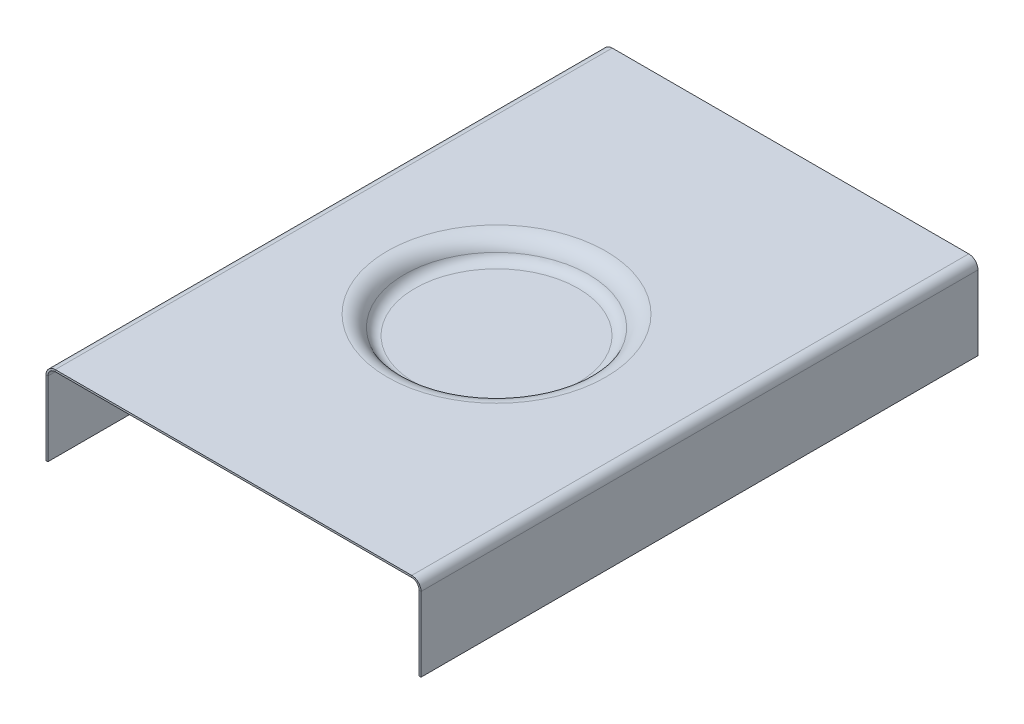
ISO-10303-21;
HEADER;
FILE_DESCRIPTION(('STEP AP214'),'2;1');
FILE_NAME('part.step','',(''),(''),'','','');
FILE_SCHEMA(('AUTOMOTIVE_DESIGN { 1 0 10303 214 1 1 1 1 }'));
ENDSEC;
DATA;
#1=APPLICATION_CONTEXT('core data for automotive mechanical design processes');
#2=APPLICATION_PROTOCOL_DEFINITION('international standard','automotive_design',2000,#1);
#3=PRODUCT_CONTEXT('',#1,'mechanical');
#4=PRODUCT('Part','Part','',(#3));
#5=PRODUCT_RELATED_PRODUCT_CATEGORY('part','',(#4));
#6=PRODUCT_DEFINITION_FORMATION('','',#4);
#7=PRODUCT_DEFINITION_CONTEXT('part definition',#1,'design');
#8=PRODUCT_DEFINITION('design','',#6,#7);
#9=PRODUCT_DEFINITION_SHAPE('','',#8);
#10=(LENGTH_UNIT() NAMED_UNIT(*) SI_UNIT(.MILLI.,.METRE.));
#11=(NAMED_UNIT(*) PLANE_ANGLE_UNIT() SI_UNIT($,.RADIAN.));
#12=(NAMED_UNIT(*) SI_UNIT($,.STERADIAN.) SOLID_ANGLE_UNIT());
#13=UNCERTAINTY_MEASURE_WITH_UNIT(LENGTH_MEASURE(1.E-05),#10,'distance_accuracy_value','');
#14=(GEOMETRIC_REPRESENTATION_CONTEXT(3) GLOBAL_UNCERTAINTY_ASSIGNED_CONTEXT((#13)) GLOBAL_UNIT_ASSIGNED_CONTEXT((#10,
#11,#12)) REPRESENTATION_CONTEXT('',''));
#15=CARTESIAN_POINT('',(0.,0.,0.));
#16=DIRECTION('',(0.,0.,1.));
#17=DIRECTION('',(1.,0.,0.));
#18=AXIS2_PLACEMENT_3D('',#15,#16,#17);
#19=CARTESIAN_POINT('',(0.,-0.5,150.));
#20=DIRECTION('',(0.,1.,0.));
#21=DIRECTION('',(0.,0.,1.));
#22=AXIS2_PLACEMENT_3D('',#19,#20,#21);
#23=PLANE('',#22);
#24=CARTESIAN_POINT('',(48.4701864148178,-0.500000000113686,77.6373406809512));
#25=DIRECTION('',(0.,1.,0.));
#26=DIRECTION('',(0.,0.,1.));
#27=AXIS2_PLACEMENT_3D('',#24,#25,#26);
#28=CIRCLE('',#27,29.4161984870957);
#29=CARTESIAN_POINT('',(48.4701864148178,-0.500000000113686,107.053539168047));
#30=VERTEX_POINT('',#29);
#31=EDGE_CURVE('E184',#30,#30,#28,.F.);
#32=ORIENTED_EDGE('',*,*,#31,.F.);
#33=EDGE_LOOP('',(#32));
#34=FACE_BOUND('',#33,.T.);
#35=DIRECTION('',(0.,0.,-1.));
#36=VECTOR('',#35,1.);
#37=CARTESIAN_POINT('',(1.99999999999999,-0.5,0.));
#38=LINE('',#37,#36);
#39=CARTESIAN_POINT('',(1.99999999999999,-0.5,0.));
#40=VERTEX_POINT('',#39);
#41=CARTESIAN_POINT('',(1.99999999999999,-0.5,150.));
#42=VERTEX_POINT('',#41);
#43=EDGE_CURVE('E160',#40,#42,#38,.F.);
#44=ORIENTED_EDGE('',*,*,#43,.F.);
#45=DIRECTION('',(1.,0.,0.));
#46=VECTOR('',#45,1.);
#47=CARTESIAN_POINT('',(0.,-0.5,0.));
#48=LINE('',#47,#46);
#49=CARTESIAN_POINT('',(98.,-0.49999999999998,0.));
#50=VERTEX_POINT('',#49);
#51=EDGE_CURVE('E152',#40,#50,#48,.T.);
#52=ORIENTED_EDGE('',*,*,#51,.T.);
#53=DIRECTION('',(0.,0.,1.));
#54=VECTOR('',#53,1.);
#55=CARTESIAN_POINT('',(98.,-0.49999999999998,150.));
#56=LINE('',#55,#54);
#57=CARTESIAN_POINT('',(98.,-0.49999999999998,150.));
#58=VERTEX_POINT('',#57);
#59=EDGE_CURVE('E100',#58,#50,#56,.F.);
#60=ORIENTED_EDGE('',*,*,#59,.F.);
#61=DIRECTION('',(1.,0.,0.));
#62=VECTOR('',#61,1.);
#63=CARTESIAN_POINT('',(0.,-0.5,150.));
#64=LINE('',#63,#62);
#65=EDGE_CURVE('E41',#42,#58,#64,.T.);
#66=ORIENTED_EDGE('',*,*,#65,.F.);
#67=EDGE_LOOP('',(#44,#52,#60,#66));
#68=FACE_BOUND('',#67,.T.);
#69=ADVANCED_FACE('F33',(#34,#68),#23,.F.);
#70=CARTESIAN_POINT('',(0.,0.,150.));
#71=DIRECTION('',(0.,1.,0.));
#72=DIRECTION('',(0.,0.,1.));
#73=AXIS2_PLACEMENT_3D('',#70,#71,#72);
#74=PLANE('',#73);
#75=CARTESIAN_POINT('',(48.4701864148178,-1.13686837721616E-10,77.6373406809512));
#76=DIRECTION('',(0.,1.,0.));
#77=DIRECTION('',(0.,0.,1.));
#78=AXIS2_PLACEMENT_3D('',#75,#76,#77);
#79=CIRCLE('',#78,29.4161984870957);
#80=CARTESIAN_POINT('',(48.4701864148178,-1.13686837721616E-10,107.053539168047));
#81=VERTEX_POINT('',#80);
#82=EDGE_CURVE('E197',#81,#81,#79,.F.);
#83=ORIENTED_EDGE('',*,*,#82,.T.);
#84=EDGE_LOOP('',(#83));
#85=FACE_BOUND('',#84,.T.);
#86=DIRECTION('',(1.,0.,0.));
#87=VECTOR('',#86,1.);
#88=CARTESIAN_POINT('',(0.,0.,0.));
#89=LINE('',#88,#87);
#90=CARTESIAN_POINT('',(1.99999999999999,0.,0.));
#91=VERTEX_POINT('',#90);
#92=CARTESIAN_POINT('',(98.,0.,0.));
#93=VERTEX_POINT('',#92);
#94=EDGE_CURVE('E36',#91,#93,#89,.T.);
#95=ORIENTED_EDGE('',*,*,#94,.F.);
#96=DIRECTION('',(0.,0.,-1.));
#97=VECTOR('',#96,1.);
#98=CARTESIAN_POINT('',(1.99999999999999,0.,0.));
#99=LINE('',#98,#97);
#100=CARTESIAN_POINT('',(1.99999999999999,0.,150.));
#101=VERTEX_POINT('',#100);
#102=EDGE_CURVE('E237',#91,#101,#99,.F.);
#103=ORIENTED_EDGE('',*,*,#102,.T.);
#104=DIRECTION('',(1.,0.,0.));
#105=VECTOR('',#104,1.);
#106=CARTESIAN_POINT('',(0.,0.,150.));
#107=LINE('',#106,#105);
#108=CARTESIAN_POINT('',(98.,0.,150.));
#109=VERTEX_POINT('',#108);
#110=EDGE_CURVE('E11',#101,#109,#107,.T.);
#111=ORIENTED_EDGE('',*,*,#110,.T.);
#112=DIRECTION('',(0.,0.,1.));
#113=VECTOR('',#112,1.);
#114=CARTESIAN_POINT('',(98.,0.,150.));
#115=LINE('',#114,#113);
#116=EDGE_CURVE('E140',#109,#93,#115,.F.);
#117=ORIENTED_EDGE('',*,*,#116,.T.);
#118=EDGE_LOOP('',(#95,#103,#111,#117));
#119=FACE_BOUND('',#118,.T.);
#120=ADVANCED_FACE('F173',(#85,#119),#74,.T.);
#121=CARTESIAN_POINT('',(100.,-0.5,150.));
#122=DIRECTION('',(0.,0.,-1.));
#123=DIRECTION('',(-1.,0.,0.));
#124=AXIS2_PLACEMENT_3D('',#121,#122,#123);
#125=PLANE('',#124);
#126=DIRECTION('',(0.,1.,0.));
#127=VECTOR('',#126,1.);
#128=CARTESIAN_POINT('',(1.99999999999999,-0.5,150.));
#129=LINE('',#128,#127);
#130=EDGE_CURVE('E125',#42,#101,#129,.T.);
#131=ORIENTED_EDGE('',*,*,#130,.F.);
#132=ORIENTED_EDGE('',*,*,#65,.T.);
#133=DIRECTION('',(0.,1.,0.));
#134=VECTOR('',#133,1.);
#135=CARTESIAN_POINT('',(98.,-0.49999999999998,150.));
#136=LINE('',#135,#134);
#137=EDGE_CURVE('E99',#58,#109,#136,.T.);
#138=ORIENTED_EDGE('',*,*,#137,.T.);
#139=ORIENTED_EDGE('',*,*,#110,.F.);
#140=EDGE_LOOP('',(#131,#132,#138,#139));
#141=FACE_BOUND('',#140,.T.);
#142=ADVANCED_FACE('F165',(#141),#125,.F.);
#143=CARTESIAN_POINT('',(100.,-0.5,0.));
#144=DIRECTION('',(0.,0.,-1.));
#145=DIRECTION('',(-1.,0.,0.));
#146=AXIS2_PLACEMENT_3D('',#143,#144,#145);
#147=PLANE('',#146);
#148=ORIENTED_EDGE('',*,*,#51,.F.);
#149=DIRECTION('',(0.,1.,0.));
#150=VECTOR('',#149,1.);
#151=CARTESIAN_POINT('',(1.99999999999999,-0.5,0.));
#152=LINE('',#151,#150);
#153=EDGE_CURVE('E243',#40,#91,#152,.T.);
#154=ORIENTED_EDGE('',*,*,#153,.T.);
#155=ORIENTED_EDGE('',*,*,#94,.T.);
#156=DIRECTION('',(0.,1.,0.));
#157=VECTOR('',#156,1.);
#158=CARTESIAN_POINT('',(98.,-0.49999999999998,0.));
#159=LINE('',#158,#157);
#160=EDGE_CURVE('E149',#50,#93,#159,.T.);
#161=ORIENTED_EDGE('',*,*,#160,.F.);
#162=EDGE_LOOP('',(#148,#154,#155,#161));
#163=FACE_BOUND('',#162,.T.);
#164=ADVANCED_FACE('F163',(#163),#147,.T.);
#165=CARTESIAN_POINT('',(98.,-2.5,0.));
#166=DIRECTION('',(0.,0.,-1.));
#167=DIRECTION('',(-1.,0.,0.));
#168=AXIS2_PLACEMENT_3D('',#165,#166,#167);
#169=PLANE('',#168);
#170=DIRECTION('',(1.,0.,0.));
#171=VECTOR('',#170,1.);
#172=CARTESIAN_POINT('',(100.,-2.49999999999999,0.));
#173=LINE('',#172,#171);
#174=CARTESIAN_POINT('',(100.,-2.49999999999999,0.));
#175=VERTEX_POINT('',#174);
#176=CARTESIAN_POINT('',(100.5,-2.49999999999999,0.));
#177=VERTEX_POINT('',#176);
#178=EDGE_CURVE('E89',#175,#177,#173,.T.);
#179=ORIENTED_EDGE('',*,*,#178,.F.);
#180=CARTESIAN_POINT('',(98.,-2.5,0.));
#181=DIRECTION('',(0.,0.,1.));
#182=DIRECTION('',(1.,0.,0.));
#183=AXIS2_PLACEMENT_3D('',#180,#181,#182);
#184=CIRCLE('',#183,2.00000000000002);
#185=EDGE_CURVE('E83',#50,#175,#184,.F.);
#186=ORIENTED_EDGE('',*,*,#185,.F.);
#187=ORIENTED_EDGE('',*,*,#160,.T.);
#188=CARTESIAN_POINT('',(98.,-2.5,0.));
#189=DIRECTION('',(0.,0.,1.));
#190=DIRECTION('',(1.,0.,0.));
#191=AXIS2_PLACEMENT_3D('',#188,#189,#190);
#192=CIRCLE('',#191,2.50000000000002);
#193=EDGE_CURVE('E142',#93,#177,#192,.F.);
#194=ORIENTED_EDGE('',*,*,#193,.T.);
#195=EDGE_LOOP('',(#179,#186,#187,#194));
#196=FACE_BOUND('',#195,.T.);
#197=ADVANCED_FACE('F162',(#196),#169,.T.);
#198=CARTESIAN_POINT('',(98.,-2.5,150.));
#199=DIRECTION('',(0.,0.,-1.));
#200=DIRECTION('',(-1.,0.,0.));
#201=AXIS2_PLACEMENT_3D('',#198,#199,#200);
#202=PLANE('',#201);
#203=CARTESIAN_POINT('',(98.,-2.5,150.));
#204=DIRECTION('',(0.,0.,1.));
#205=DIRECTION('',(1.,0.,0.));
#206=AXIS2_PLACEMENT_3D('',#203,#204,#205);
#207=CIRCLE('',#206,2.00000000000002);
#208=CARTESIAN_POINT('',(100.,-2.49999999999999,150.));
#209=VERTEX_POINT('',#208);
#210=EDGE_CURVE('E80',#209,#58,#207,.T.);
#211=ORIENTED_EDGE('',*,*,#210,.F.);
#212=DIRECTION('',(1.,0.,0.));
#213=VECTOR('',#212,1.);
#214=CARTESIAN_POINT('',(100.,-2.49999999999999,150.));
#215=LINE('',#214,#213);
#216=CARTESIAN_POINT('',(100.5,-2.49999999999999,150.));
#217=VERTEX_POINT('',#216);
#218=EDGE_CURVE('E88',#209,#217,#215,.T.);
#219=ORIENTED_EDGE('',*,*,#218,.T.);
#220=CARTESIAN_POINT('',(98.,-2.5,150.));
#221=DIRECTION('',(0.,0.,1.));
#222=DIRECTION('',(1.,0.,0.));
#223=AXIS2_PLACEMENT_3D('',#220,#221,#222);
#224=CIRCLE('',#223,2.50000000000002);
#225=EDGE_CURVE('E143',#217,#109,#224,.T.);
#226=ORIENTED_EDGE('',*,*,#225,.T.);
#227=ORIENTED_EDGE('',*,*,#137,.F.);
#228=EDGE_LOOP('',(#211,#219,#226,#227));
#229=FACE_BOUND('',#228,.T.);
#230=ADVANCED_FACE('F94',(#229),#202,.F.);
#231=CARTESIAN_POINT('',(98.,-2.5,150.));
#232=DIRECTION('',(0.,0.,1.));
#233=DIRECTION('',(1.,0.,0.));
#234=AXIS2_PLACEMENT_3D('',#231,#232,#233);
#235=CYLINDRICAL_SURFACE('',#234,2.50000000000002);
#236=ORIENTED_EDGE('',*,*,#116,.F.);
#237=ORIENTED_EDGE('',*,*,#225,.F.);
#238=DIRECTION('',(0.,0.,1.));
#239=VECTOR('',#238,1.);
#240=CARTESIAN_POINT('',(100.5,-2.49999999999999,150.));
#241=LINE('',#240,#239);
#242=EDGE_CURVE('E118',#177,#217,#241,.T.);
#243=ORIENTED_EDGE('',*,*,#242,.F.);
#244=ORIENTED_EDGE('',*,*,#193,.F.);
#245=EDGE_LOOP('',(#236,#237,#243,#244));
#246=FACE_BOUND('',#245,.T.);
#247=ADVANCED_FACE('F172',(#246),#235,.T.);
#248=CARTESIAN_POINT('',(98.,-2.5,150.));
#249=DIRECTION('',(0.,0.,1.));
#250=DIRECTION('',(1.,0.,0.));
#251=AXIS2_PLACEMENT_3D('',#248,#249,#250);
#252=CYLINDRICAL_SURFACE('',#251,2.00000000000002);
#253=ORIENTED_EDGE('',*,*,#59,.T.);
#254=ORIENTED_EDGE('',*,*,#185,.T.);
#255=DIRECTION('',(0.,0.,1.));
#256=VECTOR('',#255,1.);
#257=CARTESIAN_POINT('',(100.,-2.49999999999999,0.));
#258=LINE('',#257,#256);
#259=EDGE_CURVE('E76',#175,#209,#258,.T.);
#260=ORIENTED_EDGE('',*,*,#259,.T.);
#261=ORIENTED_EDGE('',*,*,#210,.T.);
#262=EDGE_LOOP('',(#253,#254,#260,#261));
#263=FACE_BOUND('',#262,.T.);
#264=ADVANCED_FACE('F79',(#263),#252,.F.);
#265=CARTESIAN_POINT('',(100.5,-0.499999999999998,150.));
#266=DIRECTION('',(0.,0.,1.));
#267=DIRECTION('',(1.,0.,0.));
#268=AXIS2_PLACEMENT_3D('',#265,#266,#267);
#269=PLANE('',#268);
#270=DIRECTION('',(0.,1.,0.));
#271=VECTOR('',#270,1.);
#272=CARTESIAN_POINT('',(100.5,-0.499999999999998,150.));
#273=LINE('',#272,#271);
#274=CARTESIAN_POINT('',(100.5,-22.5,150.));
#275=VERTEX_POINT('',#274);
#276=EDGE_CURVE('E117',#275,#217,#273,.T.);
#277=ORIENTED_EDGE('',*,*,#276,.T.);
#278=ORIENTED_EDGE('',*,*,#218,.F.);
#279=DIRECTION('',(0.,1.,0.));
#280=VECTOR('',#279,1.);
#281=CARTESIAN_POINT('',(100.,-0.5,150.));
#282=LINE('',#281,#280);
#283=CARTESIAN_POINT('',(100.,-22.5,150.));
#284=VERTEX_POINT('',#283);
#285=EDGE_CURVE('E105',#284,#209,#282,.T.);
#286=ORIENTED_EDGE('',*,*,#285,.F.);
#287=DIRECTION('',(-1.,0.,0.));
#288=VECTOR('',#287,1.);
#289=CARTESIAN_POINT('',(100.5,-22.5,150.));
#290=LINE('',#289,#288);
#291=EDGE_CURVE('E101',#275,#284,#290,.T.);
#292=ORIENTED_EDGE('',*,*,#291,.F.);
#293=EDGE_LOOP('',(#277,#278,#286,#292));
#294=FACE_BOUND('',#293,.T.);
#295=ADVANCED_FACE('F115',(#294),#269,.T.);
#296=CARTESIAN_POINT('',(100.5,-22.5,0.));
#297=DIRECTION('',(0.,0.,-1.));
#298=DIRECTION('',(-1.,0.,0.));
#299=AXIS2_PLACEMENT_3D('',#296,#297,#298);
#300=PLANE('',#299);
#301=DIRECTION('',(0.,-1.,0.));
#302=VECTOR('',#301,1.);
#303=CARTESIAN_POINT('',(100.,-22.5,0.));
#304=LINE('',#303,#302);
#305=CARTESIAN_POINT('',(100.,-22.5,0.));
#306=VERTEX_POINT('',#305);
#307=EDGE_CURVE('E120',#175,#306,#304,.T.);
#308=ORIENTED_EDGE('',*,*,#307,.F.);
#309=ORIENTED_EDGE('',*,*,#178,.T.);
#310=DIRECTION('',(0.,-1.,0.));
#311=VECTOR('',#310,1.);
#312=CARTESIAN_POINT('',(100.5,-22.5,0.));
#313=LINE('',#312,#311);
#314=CARTESIAN_POINT('',(100.5,-22.5,0.));
#315=VERTEX_POINT('',#314);
#316=EDGE_CURVE('E112',#177,#315,#313,.T.);
#317=ORIENTED_EDGE('',*,*,#316,.T.);
#318=DIRECTION('',(-1.,0.,0.));
#319=VECTOR('',#318,1.);
#320=CARTESIAN_POINT('',(100.5,-22.5,0.));
#321=LINE('',#320,#319);
#322=EDGE_CURVE('E133',#315,#306,#321,.T.);
#323=ORIENTED_EDGE('',*,*,#322,.T.);
#324=EDGE_LOOP('',(#308,#309,#317,#323));
#325=FACE_BOUND('',#324,.T.);
#326=ADVANCED_FACE('F294',(#325),#300,.T.);
#327=CARTESIAN_POINT('',(100.5,-0.499999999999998,150.));
#328=DIRECTION('',(1.,0.,0.));
#329=DIRECTION('',(0.,1.,0.));
#330=AXIS2_PLACEMENT_3D('',#327,#328,#329);
#331=PLANE('',#330);
#332=ORIENTED_EDGE('',*,*,#316,.F.);
#333=ORIENTED_EDGE('',*,*,#242,.T.);
#334=ORIENTED_EDGE('',*,*,#276,.F.);
#335=DIRECTION('',(0.,0.,1.));
#336=VECTOR('',#335,1.);
#337=CARTESIAN_POINT('',(100.5,-22.5,150.));
#338=LINE('',#337,#336);
#339=EDGE_CURVE('E129',#315,#275,#338,.T.);
#340=ORIENTED_EDGE('',*,*,#339,.F.);
#341=EDGE_LOOP('',(#332,#333,#334,#340));
#342=FACE_BOUND('',#341,.T.);
#343=ADVANCED_FACE('F292',(#342),#331,.T.);
#344=CARTESIAN_POINT('',(100.,-0.5,150.));
#345=DIRECTION('',(1.,0.,0.));
#346=DIRECTION('',(0.,1.,0.));
#347=AXIS2_PLACEMENT_3D('',#344,#345,#346);
#348=PLANE('',#347);
#349=ORIENTED_EDGE('',*,*,#259,.F.);
#350=ORIENTED_EDGE('',*,*,#307,.T.);
#351=DIRECTION('',(0.,0.,1.));
#352=VECTOR('',#351,1.);
#353=CARTESIAN_POINT('',(100.,-22.5,150.));
#354=LINE('',#353,#352);
#355=EDGE_CURVE('E109',#306,#284,#354,.T.);
#356=ORIENTED_EDGE('',*,*,#355,.T.);
#357=ORIENTED_EDGE('',*,*,#285,.T.);
#358=EDGE_LOOP('',(#349,#350,#356,#357));
#359=FACE_BOUND('',#358,.T.);
#360=ADVANCED_FACE('F106',(#359),#348,.F.);
#361=CARTESIAN_POINT('',(100.5,-22.5,150.));
#362=DIRECTION('',(0.,-1.,0.));
#363=DIRECTION('',(1.,0.,0.));
#364=AXIS2_PLACEMENT_3D('',#361,#362,#363);
#365=PLANE('',#364);
#366=ORIENTED_EDGE('',*,*,#355,.F.);
#367=ORIENTED_EDGE('',*,*,#322,.F.);
#368=ORIENTED_EDGE('',*,*,#339,.T.);
#369=ORIENTED_EDGE('',*,*,#291,.T.);
#370=EDGE_LOOP('',(#366,#367,#368,#369));
#371=FACE_BOUND('',#370,.T.);
#372=ADVANCED_FACE('F287',(#371),#365,.T.);
#373=CARTESIAN_POINT('',(1.99999999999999,-2.5,150.));
#374=DIRECTION('',(0.,0.,1.));
#375=DIRECTION('',(1.,0.,0.));
#376=AXIS2_PLACEMENT_3D('',#373,#374,#375);
#377=PLANE('',#376);
#378=DIRECTION('',(-1.,0.,0.));
#379=VECTOR('',#378,1.);
#380=CARTESIAN_POINT('',(0.,-2.49999999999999,150.));
#381=LINE('',#380,#379);
#382=CARTESIAN_POINT('',(0.,-2.49999999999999,150.));
#383=VERTEX_POINT('',#382);
#384=CARTESIAN_POINT('',(-0.500000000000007,-2.49999999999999,150.));
#385=VERTEX_POINT('',#384);
#386=EDGE_CURVE('E200',#383,#385,#381,.T.);
#387=ORIENTED_EDGE('',*,*,#386,.F.);
#388=CARTESIAN_POINT('',(1.99999999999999,-2.5,150.));
#389=DIRECTION('',(0.,0.,-1.));
#390=DIRECTION('',(-1.,0.,0.));
#391=AXIS2_PLACEMENT_3D('',#388,#389,#390);
#392=CIRCLE('',#391,2.);
#393=EDGE_CURVE('E246',#42,#383,#392,.F.);
#394=ORIENTED_EDGE('',*,*,#393,.F.);
#395=ORIENTED_EDGE('',*,*,#130,.T.);
#396=CARTESIAN_POINT('',(1.99999999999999,-2.5,150.));
#397=DIRECTION('',(0.,0.,-1.));
#398=DIRECTION('',(-1.,0.,0.));
#399=AXIS2_PLACEMENT_3D('',#396,#397,#398);
#400=CIRCLE('',#399,2.5);
#401=EDGE_CURVE('E239',#101,#385,#400,.F.);
#402=ORIENTED_EDGE('',*,*,#401,.T.);
#403=EDGE_LOOP('',(#387,#394,#395,#402));
#404=FACE_BOUND('',#403,.T.);
#405=ADVANCED_FACE('F357',(#404),#377,.T.);
#406=CARTESIAN_POINT('',(1.99999999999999,-2.5,0.));
#407=DIRECTION('',(0.,0.,1.));
#408=DIRECTION('',(1.,0.,0.));
#409=AXIS2_PLACEMENT_3D('',#406,#407,#408);
#410=PLANE('',#409);
#411=CARTESIAN_POINT('',(1.99999999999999,-2.5,0.));
#412=DIRECTION('',(0.,0.,-1.));
#413=DIRECTION('',(-1.,0.,0.));
#414=AXIS2_PLACEMENT_3D('',#411,#412,#413);
#415=CIRCLE('',#414,2.);
#416=CARTESIAN_POINT('',(0.,-2.49999999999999,0.));
#417=VERTEX_POINT('',#416);
#418=EDGE_CURVE('E234',#417,#40,#415,.T.);
#419=ORIENTED_EDGE('',*,*,#418,.F.);
#420=DIRECTION('',(-1.,0.,0.));
#421=VECTOR('',#420,1.);
#422=CARTESIAN_POINT('',(0.,-2.49999999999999,0.));
#423=LINE('',#422,#421);
#424=CARTESIAN_POINT('',(-0.500000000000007,-2.49999999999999,0.));
#425=VERTEX_POINT('',#424);
#426=EDGE_CURVE('E204',#417,#425,#423,.T.);
#427=ORIENTED_EDGE('',*,*,#426,.T.);
#428=CARTESIAN_POINT('',(1.99999999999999,-2.5,0.));
#429=DIRECTION('',(0.,0.,-1.));
#430=DIRECTION('',(-1.,0.,0.));
#431=AXIS2_PLACEMENT_3D('',#428,#429,#430);
#432=CIRCLE('',#431,2.5);
#433=EDGE_CURVE('E240',#425,#91,#432,.T.);
#434=ORIENTED_EDGE('',*,*,#433,.T.);
#435=ORIENTED_EDGE('',*,*,#153,.F.);
#436=EDGE_LOOP('',(#419,#427,#434,#435));
#437=FACE_BOUND('',#436,.T.);
#438=ADVANCED_FACE('F378',(#437),#410,.F.);
#439=CARTESIAN_POINT('',(1.99999999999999,-2.5,0.));
#440=DIRECTION('',(0.,0.,-1.));
#441=DIRECTION('',(-1.,0.,0.));
#442=AXIS2_PLACEMENT_3D('',#439,#440,#441);
#443=CYLINDRICAL_SURFACE('',#442,2.5);
#444=ORIENTED_EDGE('',*,*,#102,.F.);
#445=ORIENTED_EDGE('',*,*,#433,.F.);
#446=DIRECTION('',(0.,0.,-1.));
#447=VECTOR('',#446,1.);
#448=CARTESIAN_POINT('',(-0.500000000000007,-2.49999999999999,0.));
#449=LINE('',#448,#447);
#450=EDGE_CURVE('E207',#385,#425,#449,.T.);
#451=ORIENTED_EDGE('',*,*,#450,.F.);
#452=ORIENTED_EDGE('',*,*,#401,.F.);
#453=EDGE_LOOP('',(#444,#445,#451,#452));
#454=FACE_BOUND('',#453,.T.);
#455=ADVANCED_FACE('F381',(#454),#443,.T.);
#456=CARTESIAN_POINT('',(1.99999999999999,-2.5,0.));
#457=DIRECTION('',(0.,0.,-1.));
#458=DIRECTION('',(-1.,0.,0.));
#459=AXIS2_PLACEMENT_3D('',#456,#457,#458);
#460=CYLINDRICAL_SURFACE('',#459,2.);
#461=ORIENTED_EDGE('',*,*,#43,.T.);
#462=ORIENTED_EDGE('',*,*,#393,.T.);
#463=DIRECTION('',(0.,0.,-1.));
#464=VECTOR('',#463,1.);
#465=CARTESIAN_POINT('',(0.,-2.49999999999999,150.));
#466=LINE('',#465,#464);
#467=EDGE_CURVE('E201',#383,#417,#466,.T.);
#468=ORIENTED_EDGE('',*,*,#467,.T.);
#469=ORIENTED_EDGE('',*,*,#418,.T.);
#470=EDGE_LOOP('',(#461,#462,#468,#469));
#471=FACE_BOUND('',#470,.T.);
#472=ADVANCED_FACE('F391',(#471),#460,.F.);
#473=CARTESIAN_POINT('',(-0.5,-0.499999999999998,0.));
#474=DIRECTION('',(0.,0.,-1.));
#475=DIRECTION('',(-1.,0.,0.));
#476=AXIS2_PLACEMENT_3D('',#473,#474,#475);
#477=PLANE('',#476);
#478=DIRECTION('',(0.,1.,0.));
#479=VECTOR('',#478,1.);
#480=CARTESIAN_POINT('',(-0.5,-0.499999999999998,0.));
#481=LINE('',#480,#479);
#482=CARTESIAN_POINT('',(-0.500000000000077,-22.5,0.));
#483=VERTEX_POINT('',#482);
#484=EDGE_CURVE('E220',#483,#425,#481,.T.);
#485=ORIENTED_EDGE('',*,*,#484,.T.);
#486=ORIENTED_EDGE('',*,*,#426,.F.);
#487=DIRECTION('',(0.,1.,0.));
#488=VECTOR('',#487,1.);
#489=CARTESIAN_POINT('',(0.,-0.5,0.));
#490=LINE('',#489,#488);
#491=CARTESIAN_POINT('',(0.,-22.5,0.));
#492=VERTEX_POINT('',#491);
#493=EDGE_CURVE('E217',#492,#417,#490,.T.);
#494=ORIENTED_EDGE('',*,*,#493,.F.);
#495=DIRECTION('',(1.,0.,0.));
#496=VECTOR('',#495,1.);
#497=CARTESIAN_POINT('',(-0.500000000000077,-22.5,0.));
#498=LINE('',#497,#496);
#499=EDGE_CURVE('E231',#483,#492,#498,.T.);
#500=ORIENTED_EDGE('',*,*,#499,.F.);
#501=EDGE_LOOP('',(#485,#486,#494,#500));
#502=FACE_BOUND('',#501,.T.);
#503=ADVANCED_FACE('F410',(#502),#477,.T.);
#504=CARTESIAN_POINT('',(-0.500000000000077,-22.5,150.));
#505=DIRECTION('',(0.,0.,1.));
#506=DIRECTION('',(1.,0.,0.));
#507=AXIS2_PLACEMENT_3D('',#504,#505,#506);
#508=PLANE('',#507);
#509=DIRECTION('',(0.,-1.,0.));
#510=VECTOR('',#509,1.);
#511=CARTESIAN_POINT('',(0.,-22.5,150.));
#512=LINE('',#511,#510);
#513=CARTESIAN_POINT('',(0.,-22.5,150.));
#514=VERTEX_POINT('',#513);
#515=EDGE_CURVE('E212',#383,#514,#512,.T.);
#516=ORIENTED_EDGE('',*,*,#515,.F.);
#517=ORIENTED_EDGE('',*,*,#386,.T.);
#518=DIRECTION('',(0.,-1.,0.));
#519=VECTOR('',#518,1.);
#520=CARTESIAN_POINT('',(-0.500000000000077,-22.5,150.));
#521=LINE('',#520,#519);
#522=CARTESIAN_POINT('',(-0.500000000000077,-22.5,150.));
#523=VERTEX_POINT('',#522);
#524=EDGE_CURVE('E213',#385,#523,#521,.T.);
#525=ORIENTED_EDGE('',*,*,#524,.T.);
#526=DIRECTION('',(1.,0.,0.));
#527=VECTOR('',#526,1.);
#528=CARTESIAN_POINT('',(-0.500000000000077,-22.5,150.));
#529=LINE('',#528,#527);
#530=EDGE_CURVE('E223',#523,#514,#529,.T.);
#531=ORIENTED_EDGE('',*,*,#530,.T.);
#532=EDGE_LOOP('',(#516,#517,#525,#531));
#533=FACE_BOUND('',#532,.T.);
#534=ADVANCED_FACE('F420',(#533),#508,.T.);
#535=CARTESIAN_POINT('',(-0.5,-0.499999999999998,0.));
#536=DIRECTION('',(-1.,0.,0.));
#537=DIRECTION('',(0.,-1.,0.));
#538=AXIS2_PLACEMENT_3D('',#535,#536,#537);
#539=PLANE('',#538);
#540=ORIENTED_EDGE('',*,*,#524,.F.);
#541=ORIENTED_EDGE('',*,*,#450,.T.);
#542=ORIENTED_EDGE('',*,*,#484,.F.);
#543=DIRECTION('',(0.,0.,-1.));
#544=VECTOR('',#543,1.);
#545=CARTESIAN_POINT('',(-0.500000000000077,-22.5,0.));
#546=LINE('',#545,#544);
#547=EDGE_CURVE('E216',#523,#483,#546,.T.);
#548=ORIENTED_EDGE('',*,*,#547,.F.);
#549=EDGE_LOOP('',(#540,#541,#542,#548));
#550=FACE_BOUND('',#549,.T.);
#551=ADVANCED_FACE('F431',(#550),#539,.T.);
#552=CARTESIAN_POINT('',(0.,-0.5,0.));
#553=DIRECTION('',(-1.,0.,0.));
#554=DIRECTION('',(0.,-1.,0.));
#555=AXIS2_PLACEMENT_3D('',#552,#553,#554);
#556=PLANE('',#555);
#557=ORIENTED_EDGE('',*,*,#467,.F.);
#558=ORIENTED_EDGE('',*,*,#515,.T.);
#559=DIRECTION('',(0.,0.,-1.));
#560=VECTOR('',#559,1.);
#561=CARTESIAN_POINT('',(0.,-22.5,0.));
#562=LINE('',#561,#560);
#563=EDGE_CURVE('E226',#514,#492,#562,.T.);
#564=ORIENTED_EDGE('',*,*,#563,.T.);
#565=ORIENTED_EDGE('',*,*,#493,.T.);
#566=EDGE_LOOP('',(#557,#558,#564,#565));
#567=FACE_BOUND('',#566,.T.);
#568=ADVANCED_FACE('F442',(#567),#556,.F.);
#569=CARTESIAN_POINT('',(-0.500000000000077,-22.5,0.));
#570=DIRECTION('',(0.,-1.,0.));
#571=DIRECTION('',(1.,0.,0.));
#572=AXIS2_PLACEMENT_3D('',#569,#570,#571);
#573=PLANE('',#572);
#574=ORIENTED_EDGE('',*,*,#563,.F.);
#575=ORIENTED_EDGE('',*,*,#530,.F.);
#576=ORIENTED_EDGE('',*,*,#547,.T.);
#577=ORIENTED_EDGE('',*,*,#499,.T.);
#578=EDGE_LOOP('',(#574,#575,#576,#577));
#579=FACE_BOUND('',#578,.T.);
#580=ADVANCED_FACE('F453',(#579),#573,.T.);
#581=CARTESIAN_POINT('',(48.4701864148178,-5.00000000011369,77.6373406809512));
#582=DIRECTION('',(0.,1.,0.));
#583=DIRECTION('',(0.,0.,1.));
#584=AXIS2_PLACEMENT_3D('',#581,#582,#583);
#585=TOROIDAL_SURFACE('',#584,29.4161984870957,5.);
#586=ORIENTED_EDGE('',*,*,#82,.F.);
#587=EDGE_LOOP('',(#586));
#588=FACE_BOUND('',#587,.T.);
#589=CARTESIAN_POINT('',(48.4701864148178,-3.12500000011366,77.6373406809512));
#590=DIRECTION('',(0.,1.,0.));
#591=DIRECTION('',(0.,0.,1.));
#592=AXIS2_PLACEMENT_3D('',#589,#590,#591);
#593=CIRCLE('',#592,24.7810744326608);
#594=CARTESIAN_POINT('',(48.4701864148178,-3.12500000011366,102.418415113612));
#595=VERTEX_POINT('',#594);
#596=EDGE_CURVE('E190',#595,#595,#593,.F.);
#597=ORIENTED_EDGE('',*,*,#596,.T.);
#598=EDGE_LOOP('',(#597));
#599=FACE_BOUND('',#598,.T.);
#600=ADVANCED_FACE('F463',(#588,#599),#585,.T.);
#601=CARTESIAN_POINT('',(48.4701864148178,-5.50000000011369,77.6373406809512));
#602=DIRECTION('',(0.,-1.,0.));
#603=DIRECTION('',(0.,0.,-1.));
#604=AXIS2_PLACEMENT_3D('',#601,#602,#603);
#605=PLANE('',#604);
#606=CARTESIAN_POINT('',(48.4701864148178,-5.50000000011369,77.6373406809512));
#607=DIRECTION('',(0.,-1.,0.));
#608=DIRECTION('',(0.,0.,-1.));
#609=AXIS2_PLACEMENT_3D('',#606,#607,#608);
#610=CIRCLE('',#609,22.);
#611=CARTESIAN_POINT('',(48.4701864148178,-5.50000000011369,55.6373406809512));
#612=VERTEX_POINT('',#611);
#613=EDGE_CURVE('E193',#612,#612,#610,.T.);
#614=ORIENTED_EDGE('',*,*,#613,.T.);
#615=EDGE_LOOP('',(#614));
#616=FACE_BOUND('',#615,.T.);
#617=ADVANCED_FACE('F485',(#616),#605,.T.);
#618=CARTESIAN_POINT('',(48.4701864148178,-2.00000000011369,77.6373406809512));
#619=DIRECTION('',(0.,-1.,0.));
#620=DIRECTION('',(0.,0.,-1.));
#621=AXIS2_PLACEMENT_3D('',#618,#619,#620);
#622=TOROIDAL_SURFACE('',#621,22.,3.5);
#623=CARTESIAN_POINT('',(48.4701864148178,-3.31250000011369,77.6373406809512));
#624=DIRECTION('',(0.,-1.,0.));
#625=DIRECTION('',(0.,0.,-1.));
#626=AXIS2_PLACEMENT_3D('',#623,#624,#625);
#627=CIRCLE('',#626,25.2445868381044);
#628=CARTESIAN_POINT('',(48.4701864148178,-3.31250000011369,52.3927538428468));
#629=VERTEX_POINT('',#628);
#630=EDGE_CURVE('E187',#629,#629,#627,.T.);
#631=ORIENTED_EDGE('',*,*,#630,.T.);
#632=EDGE_LOOP('',(#631));
#633=FACE_BOUND('',#632,.T.);
#634=ORIENTED_EDGE('',*,*,#613,.F.);
#635=EDGE_LOOP('',(#634));
#636=FACE_BOUND('',#635,.T.);
#637=ADVANCED_FACE('F495',(#633,#636),#622,.T.);
#638=CARTESIAN_POINT('',(48.4701864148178,-5.00000000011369,77.6373406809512));
#639=DIRECTION('',(0.,1.,0.));
#640=DIRECTION('',(0.,0.,1.));
#641=AXIS2_PLACEMENT_3D('',#638,#639,#640);
#642=TOROIDAL_SURFACE('',#641,29.4161984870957,4.5);
#643=ORIENTED_EDGE('',*,*,#31,.T.);
#644=EDGE_LOOP('',(#643));
#645=FACE_BOUND('',#644,.T.);
#646=ORIENTED_EDGE('',*,*,#630,.F.);
#647=EDGE_LOOP('',(#646));
#648=FACE_BOUND('',#647,.T.);
#649=ADVANCED_FACE('F505',(#645,#648),#642,.F.);
#650=CARTESIAN_POINT('',(48.4701864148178,-2.00000000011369,77.6373406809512));
#651=DIRECTION('',(0.,-1.,0.));
#652=DIRECTION('',(0.,0.,-1.));
#653=AXIS2_PLACEMENT_3D('',#650,#651,#652);
#654=TOROIDAL_SURFACE('',#653,22.,3.);
#655=ORIENTED_EDGE('',*,*,#596,.F.);
#656=EDGE_LOOP('',(#655));
#657=FACE_BOUND('',#656,.T.);
#658=CARTESIAN_POINT('',(48.4701864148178,-5.00000000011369,77.6373406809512));
#659=DIRECTION('',(0.,-1.,0.));
#660=DIRECTION('',(0.,0.,-1.));
#661=AXIS2_PLACEMENT_3D('',#658,#659,#660);
#662=CIRCLE('',#661,22.);
#663=CARTESIAN_POINT('',(48.4701864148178,-5.00000000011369,55.6373406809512));
#664=VERTEX_POINT('',#663);
#665=EDGE_CURVE('E186',#664,#664,#662,.T.);
#666=ORIENTED_EDGE('',*,*,#665,.T.);
#667=EDGE_LOOP('',(#666));
#668=FACE_BOUND('',#667,.T.);
#669=ADVANCED_FACE('F515',(#657,#668),#654,.F.);
#670=CARTESIAN_POINT('',(48.4701864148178,-5.00000000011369,77.6373406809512));
#671=DIRECTION('',(0.,-1.,0.));
#672=DIRECTION('',(0.,0.,-1.));
#673=AXIS2_PLACEMENT_3D('',#670,#671,#672);
#674=PLANE('',#673);
#675=ORIENTED_EDGE('',*,*,#665,.F.);
#676=EDGE_LOOP('',(#675));
#677=FACE_BOUND('',#676,.T.);
#678=ADVANCED_FACE('F524',(#677),#674,.F.);
#679=CLOSED_SHELL('',(#69,#120,#142,#164,#197,#230,#247,#264,#295,#326,#343,#360,#372,#405,#438,
#455,#472,#503,#534,#551,#568,#580,#600,#617,#637,#649,#669,#678));
#680=MANIFOLD_SOLID_BREP('B2',#679);
#681=ADVANCED_BREP_SHAPE_REPRESENTATION('',(#18,#680),#14);
#682=SHAPE_DEFINITION_REPRESENTATION(#9,#681);
ENDSEC;
END-ISO-10303-21;
